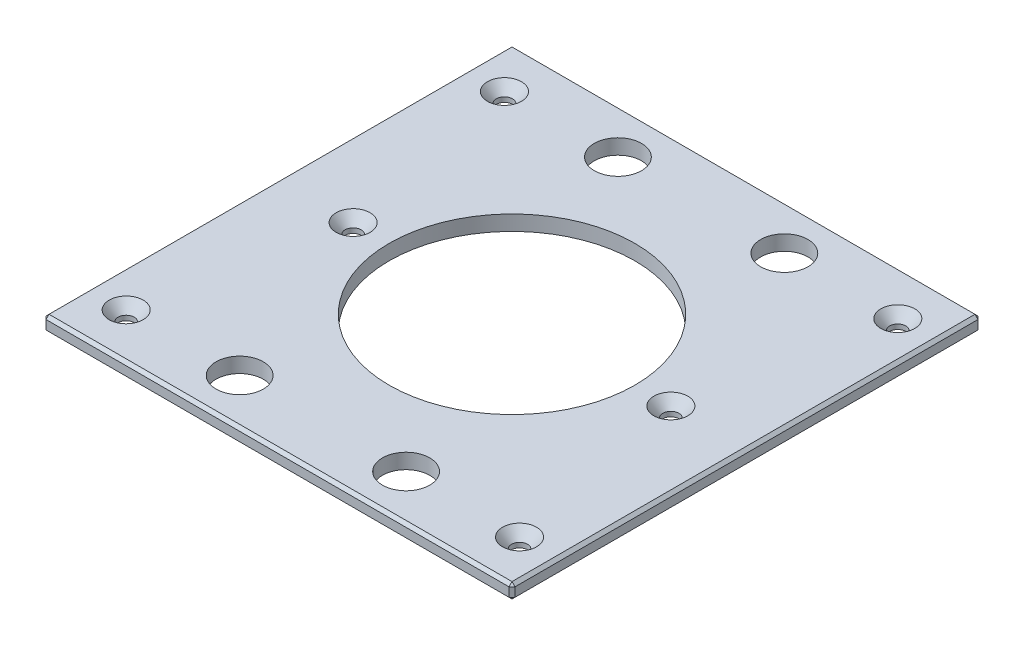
from build123d import *

# Parameters (mm, degrees)
SKETCH1_W                                     = 196.85
SKETCH1_H                                     = 196.85
BOSS_EXTRUDE1_DEPTH                           = 6.35
SKETCH13_R                                    = 51.562
CUT_EXTRUDE6_DEPTH                            = 140.338737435
F_25_32_0_78125_DIAMETER_HOLE1_D              = 19.84375
CHAMFER2_SIZE                                 = 1.27
CSK_FOR_1_4_FLAT_HEAD_MACHINE_SCREW1_AT_COUNT = 2
CSK_FOR_1_4_FLAT_HEAD_MACHINE_SCREW1_AT_PITCH = 158.75
CSK_FOR_1_4_FLAT_HEAD_MACHINE_SCREW1_2_COUNT  = 2
CSK_FOR_1_4_FLAT_HEAD_MACHINE_SCREW1_2_PITCH  = 229.04054772
CSK_FOR_1_4_FLAT_HEAD_MACHINE_SCREW1_3_COUNT  = 2
CSK_FOR_1_4_FLAT_HEAD_MACHINE_SCREW1_3_PITCH  = 169.022162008
CSK_FOR_1_4_FLAT_HEAD_MACHINE_SCREW1_4_COUNT  = 2
CSK_FOR_1_4_FLAT_HEAD_MACHINE_SCREW1_4_PITCH  = 80.946934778
CSK_FOR_1_4_FLAT_HEAD_MACHINE_SCREW1_5_COUNT  = 2
CSK_FOR_1_4_FLAT_HEAD_MACHINE_SCREW1_5_PITCH  = 165.1
CSK_FOR_1_4_FLAT_HEAD_MACHINE_SCREW1_6_COUNT  = 2
CSK_FOR_1_4_FLAT_HEAD_MACHINE_SCREW1_6_PITCH  = 117.475
CSK_FOR_1_4_FLAT_HEAD_MACHINE_SCREW1_7_COUNT  = 2
CSK_FOR_1_4_FLAT_HEAD_MACHINE_SCREW1_7_PITCH  = 197.489083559


with BuildPart() as part:
    # Sketch1 → Boss-Extrude1 (new body)
    with BuildSketch(Plane(origin=(0, 0, 0), x_dir=(1, 0, 0), z_dir=(0, 1, 0))):
        Rectangle(SKETCH1_W, SKETCH1_H)
    extrude(amount=BOSS_EXTRUDE1_DEPTH)

    # Sketch13 → Cut-Extrude6 (cut, through all)
    with BuildSketch(Plane(origin=(0, 6.35, 0), x_dir=(1, 0, 0), z_dir=(0, 1, 0))):
        with Locations(Location((0, 0, 0), (0, 0, 270))):
            Circle(SKETCH13_R)
    extrude(amount=-CUT_EXTRUDE6_DEPTH, mode=Mode.SUBTRACT)

    # 25_32 _0.78125_ Diameter Hole1 (through all)
    with Locations(Plane(origin=(0, 6.35, 0), x_dir=(1, 0, 0), z_dir=(0, 1, 0))):
        with Locations((34.925, 79.375), (-34.925, 79.375), (34.925, -79.375), (-34.925, -79.375)):
            Hole(F_25_32_0_78125_DIAMETER_HOLE1_D / 2)

    # Chamfer2
    chamfer2_edges = [part.edges().sort_by_distance(p)[0] for p in [
        (98.425, 6.35, 0),
        (0, 6.35, -98.425),
        (-98.425, 6.35, 0),
        (0, 0, -98.425),
        (98.425, 0, 0),
        (0, 0, 98.425),
        (-98.425, 0, 0),
        (0, 6.35, 98.425),
        (-98.425, 3.175, -98.425),
        (98.425, 3.175, -98.425),
        (98.425, 3.175, 98.425),
        (-98.425, 3.175, 98.425),
    ]]
    chamfer(chamfer2_edges, length=CHAMFER2_SIZE)

    # Sketch24 → CSK for 1_4 Flat Head Machine Screw1 (revolve, cut)
    with BuildSketch(Plane(origin=(82.55, 6.35, -79.375), x_dir=(0, 0, 1), z_dir=(1, 0, 0))):
        Polygon((0, 0), (0, 6.35), (3.3782, 6.35), (3.3782, 4.324464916), (7.1374, 0), align=None)
    csk_for_1_4_flat_head_machine_screw1 = revolve(axis=Axis((82.55, 12.7, -79.375), (0, -1, 0)), mode=Mode.SUBTRACT)

    # CSK for 1_4 Flat Head Machine Screw1 at: CSK for 1_4 Flat Head Machine Screw1 ×2
    with Locations(*[(0, 0, i * CSK_FOR_1_4_FLAT_HEAD_MACHINE_SCREW1_AT_PITCH) for i in range(1, CSK_FOR_1_4_FLAT_HEAD_MACHINE_SCREW1_AT_COUNT)]):
        add(csk_for_1_4_flat_head_machine_screw1, mode=Mode.SUBTRACT)

    # CSK for 1_4 Flat Head Machine Screw1 2: CSK for 1_4 Flat Head Machine Screw1 ×2
    with Locations(*[Vector(-0.7208330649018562, 0, 0.6931087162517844) * (i * CSK_FOR_1_4_FLAT_HEAD_MACHINE_SCREW1_2_PITCH) for i in range(1, CSK_FOR_1_4_FLAT_HEAD_MACHINE_SCREW1_2_COUNT)]):
        add(csk_for_1_4_flat_head_machine_screw1, mode=Mode.SUBTRACT)

    # CSK for 1_4 Flat Head Machine Screw1 3: CSK for 1_4 Flat Head Machine Screw1 ×2
    with Locations(*[Vector(-0.8828723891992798, 0, 0.46961297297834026) * (i * CSK_FOR_1_4_FLAT_HEAD_MACHINE_SCREW1_3_PITCH) for i in range(1, CSK_FOR_1_4_FLAT_HEAD_MACHINE_SCREW1_3_COUNT)]):
        add(csk_for_1_4_flat_head_machine_screw1, mode=Mode.SUBTRACT)

    # CSK for 1_4 Flat Head Machine Screw1 4: CSK for 1_4 Flat Head Machine Screw1 ×2
    with Locations(*[Vector(-0.19611613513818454, 0, 0.9805806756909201) * (i * CSK_FOR_1_4_FLAT_HEAD_MACHINE_SCREW1_4_PITCH) for i in range(1, CSK_FOR_1_4_FLAT_HEAD_MACHINE_SCREW1_4_COUNT)]):
        add(csk_for_1_4_flat_head_machine_screw1, mode=Mode.SUBTRACT)

    # CSK for 1_4 Flat Head Machine Screw1 5: CSK for 1_4 Flat Head Machine Screw1 ×2
    with Locations(*[(-i * CSK_FOR_1_4_FLAT_HEAD_MACHINE_SCREW1_5_PITCH, 0, 0) for i in range(1, CSK_FOR_1_4_FLAT_HEAD_MACHINE_SCREW1_5_COUNT)]):
        add(csk_for_1_4_flat_head_machine_screw1, mode=Mode.SUBTRACT)

    # CSK for 1_4 Flat Head Machine Screw1 6: CSK for 1_4 Flat Head Machine Screw1 ×2
    with Locations(*[(-i * CSK_FOR_1_4_FLAT_HEAD_MACHINE_SCREW1_6_PITCH, 0, 0) for i in range(1, CSK_FOR_1_4_FLAT_HEAD_MACHINE_SCREW1_6_COUNT)]):
        add(csk_for_1_4_flat_head_machine_screw1, mode=Mode.SUBTRACT)

    # CSK for 1_4 Flat Head Machine Screw1 7: CSK for 1_4 Flat Head Machine Screw1 ×2
    with Locations(*[Vector(-0.5948430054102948, 0, 0.8038418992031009) * (i * CSK_FOR_1_4_FLAT_HEAD_MACHINE_SCREW1_7_PITCH) for i in range(1, CSK_FOR_1_4_FLAT_HEAD_MACHINE_SCREW1_7_COUNT)]):
        add(csk_for_1_4_flat_head_machine_screw1, mode=Mode.SUBTRACT)


solid = part.part
